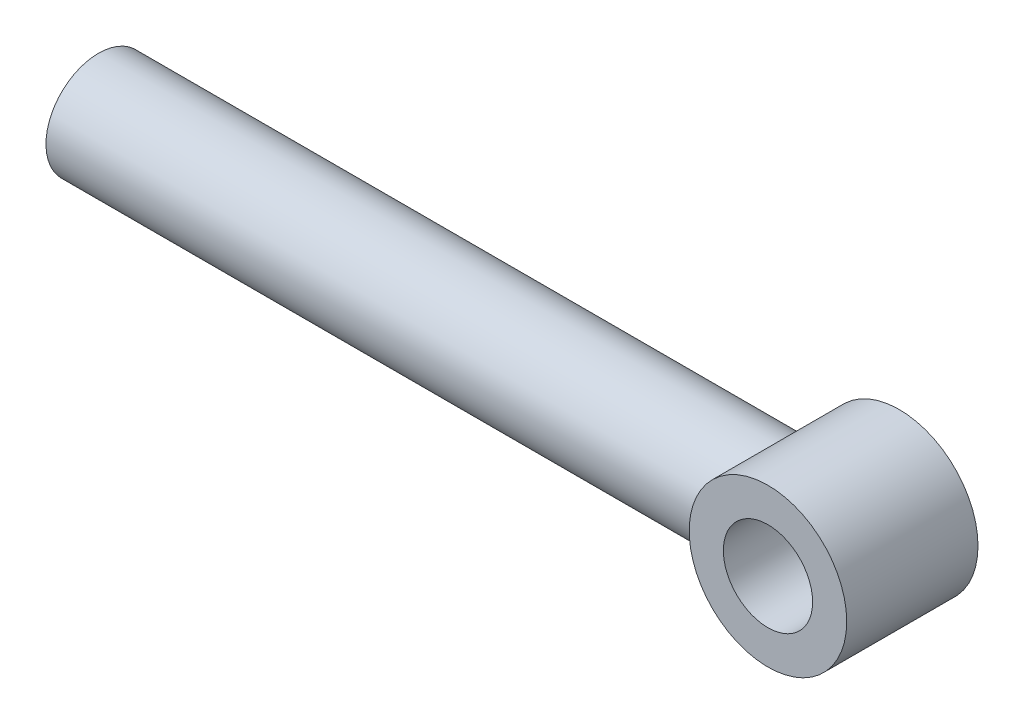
ISO-10303-21;
HEADER;
FILE_DESCRIPTION(('STEP AP214'),'2;1');
FILE_NAME('part.step','',(''),(''),'','','');
FILE_SCHEMA(('AUTOMOTIVE_DESIGN { 1 0 10303 214 1 1 1 1 }'));
ENDSEC;
DATA;
#1=APPLICATION_CONTEXT('core data for automotive mechanical design processes');
#2=APPLICATION_PROTOCOL_DEFINITION('international standard','automotive_design',2000,#1);
#3=PRODUCT_CONTEXT('',#1,'mechanical');
#4=PRODUCT('Part','Part','',(#3));
#5=PRODUCT_RELATED_PRODUCT_CATEGORY('part','',(#4));
#6=PRODUCT_DEFINITION_FORMATION('','',#4);
#7=PRODUCT_DEFINITION_CONTEXT('part definition',#1,'design');
#8=PRODUCT_DEFINITION('design','',#6,#7);
#9=PRODUCT_DEFINITION_SHAPE('','',#8);
#10=(LENGTH_UNIT() NAMED_UNIT(*) SI_UNIT(.MILLI.,.METRE.));
#11=(NAMED_UNIT(*) PLANE_ANGLE_UNIT() SI_UNIT($,.RADIAN.));
#12=(NAMED_UNIT(*) SI_UNIT($,.STERADIAN.) SOLID_ANGLE_UNIT());
#13=UNCERTAINTY_MEASURE_WITH_UNIT(LENGTH_MEASURE(1.E-05),#10,'distance_accuracy_value','');
#14=(GEOMETRIC_REPRESENTATION_CONTEXT(3) GLOBAL_UNCERTAINTY_ASSIGNED_CONTEXT((#13)) GLOBAL_UNIT_ASSIGNED_CONTEXT((#10,
#11,#12)) REPRESENTATION_CONTEXT('',''));
#15=CARTESIAN_POINT('',(0.,0.,0.));
#16=DIRECTION('',(0.,0.,1.));
#17=DIRECTION('',(1.,0.,0.));
#18=AXIS2_PLACEMENT_3D('',#15,#16,#17);
#19=CARTESIAN_POINT('',(0.,0.,62.5));
#20=DIRECTION('',(0.,0.,-1.));
#21=DIRECTION('',(-1.,0.,0.));
#22=AXIS2_PLACEMENT_3D('',#19,#20,#21);
#23=CYLINDRICAL_SURFACE('',#22,75.);
#24=CARTESIAN_POINT('',(0.,0.,-62.5));
#25=DIRECTION('',(0.,0.,1.));
#26=DIRECTION('',(1.,0.,0.));
#27=AXIS2_PLACEMENT_3D('',#24,#25,#26);
#28=CIRCLE('',#27,75.);
#29=CARTESIAN_POINT('',(75.,0.,-62.5));
#30=VERTEX_POINT('',#29);
#31=EDGE_CURVE('E47',#30,#30,#28,.T.);
#32=ORIENTED_EDGE('',*,*,#31,.T.);
#33=EDGE_LOOP('',(#32));
#34=FACE_BOUND('',#33,.T.);
#35=CARTESIAN_POINT('',(0.,0.,62.5));
#36=DIRECTION('',(0.,0.,1.));
#37=DIRECTION('',(1.,0.,0.));
#38=AXIS2_PLACEMENT_3D('',#35,#36,#37);
#39=CIRCLE('',#38,75.);
#40=CARTESIAN_POINT('',(75.,0.,62.5));
#41=VERTEX_POINT('',#40);
#42=EDGE_CURVE('E43',#41,#41,#39,.T.);
#43=ORIENTED_EDGE('',*,*,#42,.F.);
#44=EDGE_LOOP('',(#43));
#45=FACE_BOUND('',#44,.T.);
#46=CARTESIAN_POINT('',(-75.,0.,50.));
#47=CARTESIAN_POINT('',(-74.9999993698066,1.25607912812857,49.9999992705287));
#48=CARTESIAN_POINT('',(-74.9683781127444,2.51216621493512,49.9526046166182));
#49=CARTESIAN_POINT('',(-74.8426887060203,5.01407179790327,49.7637718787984));
#50=CARTESIAN_POINT('',(-74.7486202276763,6.25989023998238,49.6223332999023));
#51=CARTESIAN_POINT('',(-74.5003130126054,8.73197178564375,49.2475006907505));
#52=CARTESIAN_POINT('',(-74.3460508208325,9.95822707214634,49.0140708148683));
#53=CARTESIAN_POINT('',(-73.9810246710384,12.3818417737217,48.4585988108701));
#54=CARTESIAN_POINT('',(-73.7702600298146,13.5792008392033,48.1365556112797));
#55=CARTESIAN_POINT('',(-73.2981128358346,15.9317078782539,47.409801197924));
#56=CARTESIAN_POINT('',(-73.0369769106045,17.0870301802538,47.0054922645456));
#57=CARTESIAN_POINT('',(-72.4689183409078,19.3551767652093,46.1178965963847));
#58=CARTESIAN_POINT('',(-72.1619959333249,20.4680012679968,45.6346102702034));
#59=CARTESIAN_POINT('',(-71.5083591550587,22.6461387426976,44.5938272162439));
#60=CARTESIAN_POINT('',(-71.1616447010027,23.7114516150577,44.0363303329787));
#61=CARTESIAN_POINT('',(-70.4347519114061,25.790674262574,42.851755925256));
#62=CARTESIAN_POINT('',(-70.0545719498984,26.8045815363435,42.2246750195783));
#63=CARTESIAN_POINT('',(-69.2338946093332,28.861666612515,40.849261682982));
#64=CARTESIAN_POINT('',(-68.7910162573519,29.9000336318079,40.0951562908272));
#65=CARTESIAN_POINT('',(-67.8821640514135,31.9096887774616,38.5150098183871));
#66=CARTESIAN_POINT('',(-67.4161891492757,32.8809738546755,37.6889654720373));
#67=CARTESIAN_POINT('',(-66.4693490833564,34.7552786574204,35.9679238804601));
#68=CARTESIAN_POINT('',(-65.9884648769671,35.6582055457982,35.0728360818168));
#69=CARTESIAN_POINT('',(-65.0216326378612,37.3921493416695,33.2180538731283));
#70=CARTESIAN_POINT('',(-64.5356843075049,38.2231619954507,32.2583556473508));
#71=CARTESIAN_POINT('',(-63.4920916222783,39.9363542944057,30.1205689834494));
#72=CARTESIAN_POINT('',(-62.9352413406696,40.8058966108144,28.9319232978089));
#73=CARTESIAN_POINT('',(-61.8442348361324,42.4412194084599,26.4749144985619));
#74=CARTESIAN_POINT('',(-61.3100837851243,43.2069763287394,25.2065333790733));
#75=CARTESIAN_POINT('',(-60.2836354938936,44.6279110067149,22.595480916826));
#76=CARTESIAN_POINT('',(-59.7912819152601,45.2832388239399,21.2529137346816));
#77=CARTESIAN_POINT('',(-58.8680528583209,46.4771135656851,18.4967747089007));
#78=CARTESIAN_POINT('',(-58.4371478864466,47.0157165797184,17.0832373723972));
#79=CARTESIAN_POINT('',(-57.7708886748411,47.8300721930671,14.6101230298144));
#80=CARTESIAN_POINT('',(-57.5149970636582,48.1368155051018,13.5662004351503));
#81=CARTESIAN_POINT('',(-57.0529757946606,48.6835315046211,11.4502022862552));
#82=CARTESIAN_POINT('',(-56.8468380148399,48.9235150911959,10.3781313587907));
#83=CARTESIAN_POINT('',(-56.4917106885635,49.3331558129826,8.21290481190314));
#84=CARTESIAN_POINT('',(-56.3426367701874,49.5029168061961,7.119782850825));
#85=CARTESIAN_POINT('',(-56.1069379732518,49.7699049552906,4.91794365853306));
#86=CARTESIAN_POINT('',(-56.0203134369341,49.8671317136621,3.80922634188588));
#87=CARTESIAN_POINT('',(-55.9128944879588,49.9875475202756,1.57993457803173));
#88=CARTESIAN_POINT('',(-55.8923741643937,50.0104283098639,0.459330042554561));
#89=CARTESIAN_POINT('',(-55.9188255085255,49.9808494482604,-1.780076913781));
#90=CARTESIAN_POINT('',(-55.9657974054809,49.9283895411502,-2.89887932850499));
#91=CARTESIAN_POINT('',(-56.1252713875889,49.7490517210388,-5.12656174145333));
#92=CARTESIAN_POINT('',(-56.2378221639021,49.6221185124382,-6.23543374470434));
#93=CARTESIAN_POINT('',(-56.523896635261,49.2960030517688,-8.43444104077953));
#94=CARTESIAN_POINT('',(-56.6974214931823,49.096819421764,-9.52457597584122));
#95=CARTESIAN_POINT('',(-57.0900007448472,48.6396771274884,-11.6315017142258));
#96=CARTESIAN_POINT('',(-57.3066828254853,48.3847316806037,-12.649396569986));
#97=CARTESIAN_POINT('',(-57.7832883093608,47.8145330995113,-14.6581382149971));
#98=CARTESIAN_POINT('',(-58.0432284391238,47.4992566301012,-15.6489743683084));
#99=CARTESIAN_POINT('',(-58.5993950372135,46.8113917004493,-17.6001100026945));
#100=CARTESIAN_POINT('',(-58.8956252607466,46.4387973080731,-18.5604063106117));
#101=CARTESIAN_POINT('',(-59.5174078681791,45.6391782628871,-20.4478801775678));
#102=CARTESIAN_POINT('',(-59.8429537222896,45.2121657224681,-21.3750650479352));
#103=CARTESIAN_POINT('',(-60.5855151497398,44.2137646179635,-23.3803350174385));
#104=CARTESIAN_POINT('',(-61.0076592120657,43.6306819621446,-24.4507093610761));
#105=CARTESIAN_POINT('',(-61.8743922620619,42.3925789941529,-26.5394717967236));
#106=CARTESIAN_POINT('',(-62.3189833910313,41.7375518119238,-27.5578549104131));
#107=CARTESIAN_POINT('',(-63.2213580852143,40.3576530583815,-29.5418590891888));
#108=CARTESIAN_POINT('',(-63.6791556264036,39.6327054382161,-30.5074208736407));
#109=CARTESIAN_POINT('',(-64.5984937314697,38.1158937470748,-32.382604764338));
#110=CARTESIAN_POINT('',(-65.0600345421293,37.3240252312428,-33.2922231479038));
#111=CARTESIAN_POINT('',(-66.0776235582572,35.4973720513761,-35.2432553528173));
#112=CARTESIAN_POINT('',(-66.6325757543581,34.4470402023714,-36.2707577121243));
#113=CARTESIAN_POINT('',(-67.7214915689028,32.2536688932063,-38.2343790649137));
#114=CARTESIAN_POINT('',(-68.255451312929,31.1106124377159,-39.1704812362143));
#115=CARTESIAN_POINT('',(-69.2883502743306,28.7367153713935,-40.9437956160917));
#116=CARTESIAN_POINT('',(-69.7873150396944,27.5059401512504,-41.7810802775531));
#117=CARTESIAN_POINT('',(-70.7374190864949,24.9611838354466,-43.3494130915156));
#118=CARTESIAN_POINT('',(-71.1885715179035,23.6472257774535,-44.0804904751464));
#119=CARTESIAN_POINT('',(-71.9479110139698,21.2083653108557,-45.2954763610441));
#120=CARTESIAN_POINT('',(-72.2667869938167,20.0968929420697,-45.7997439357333));
#121=CARTESIAN_POINT('',(-72.85929326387,17.8296258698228,-46.7290579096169));
#122=CARTESIAN_POINT('',(-73.1329288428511,16.6738363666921,-47.1541135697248));
#123=CARTESIAN_POINT('',(-73.629069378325,14.3248068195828,-47.9199844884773));
#124=CARTESIAN_POINT('',(-73.8516086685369,13.1315925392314,-48.2608563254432));
#125=CARTESIAN_POINT('',(-74.2408263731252,10.7143858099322,-48.8543809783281));
#126=CARTESIAN_POINT('',(-74.4075039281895,9.49039288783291,-49.1070324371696));
#127=CARTESIAN_POINT('',(-74.6816447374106,7.0149328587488,-49.5214332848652));
#128=CARTESIAN_POINT('',(-74.7888458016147,5.76336899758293,-49.6827802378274));
#129=CARTESIAN_POINT('',(-74.9402390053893,3.24779978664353,-49.9103863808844));
#130=CARTESIAN_POINT('',(-74.9844310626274,1.98379442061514,-49.9766454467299));
#131=CARTESIAN_POINT('',(-75.0086794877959,-0.546161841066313,-50.0130200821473));
#132=CARTESIAN_POINT('',(-74.9887384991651,-1.81211265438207,-49.9831396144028));
#133=CARTESIAN_POINT('',(-74.8852333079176,-4.33545391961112,-49.8277186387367));
#134=CARTESIAN_POINT('',(-74.8016718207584,-5.59284473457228,-49.7021822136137));
#135=CARTESIAN_POINT('',(-74.5811036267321,-8.00105441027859,-49.3695781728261));
#136=CARTESIAN_POINT('',(-74.4482725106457,-9.1531452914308,-49.1688708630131));
#137=CARTESIAN_POINT('',(-74.1322766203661,-11.4337539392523,-48.6890852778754));
#138=CARTESIAN_POINT('',(-73.949114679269,-12.5622730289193,-48.4100114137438));
#139=CARTESIAN_POINT('',(-73.5361116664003,-14.7892901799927,-47.7767443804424));
#140=CARTESIAN_POINT('',(-73.3062675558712,-15.8877862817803,-47.422546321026));
#141=CARTESIAN_POINT('',(-72.8042512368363,-18.0491596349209,-46.6427698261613));
#142=CARTESIAN_POINT('',(-72.5320767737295,-19.1120349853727,-46.217187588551));
#143=CARTESIAN_POINT('',(-71.9326221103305,-21.2606669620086,-45.2707880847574));
#144=CARTESIAN_POINT('',(-71.6030042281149,-22.3439174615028,-44.7457668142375));
#145=CARTESIAN_POINT('',(-70.9077575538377,-24.4608128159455,-43.6245744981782));
#146=CARTESIAN_POINT('',(-70.5421276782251,-25.4944561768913,-43.0284013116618));
#147=CARTESIAN_POINT('',(-69.7810939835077,-27.5092556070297,-41.7690428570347));
#148=CARTESIAN_POINT('',(-69.3856760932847,-28.4903864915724,-41.10582586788));
#149=CARTESIAN_POINT('',(-68.5718169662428,-30.3970494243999,-39.7166332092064));
#150=CARTESIAN_POINT('',(-68.1533744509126,-31.3225783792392,-38.9906540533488));
#151=CARTESIAN_POINT('',(-67.2327199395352,-33.2578367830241,-37.3598822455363));
#152=CARTESIAN_POINT('',(-66.7277262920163,-34.2577309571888,-36.4449686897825));
#153=CARTESIAN_POINT('',(-65.7067457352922,-36.1774209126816,-34.5401662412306));
#154=CARTESIAN_POINT('',(-65.1907573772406,-37.0972060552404,-33.5502674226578));
#155=CARTESIAN_POINT('',(-64.1589349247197,-38.8544700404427,-31.4985058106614));
#156=CARTESIAN_POINT('',(-63.6431011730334,-39.6918925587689,-30.4365945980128));
#157=CARTESIAN_POINT('',(-62.6243153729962,-41.2805689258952,-28.2444115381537));
#158=CARTESIAN_POINT('',(-62.121362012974,-42.0318315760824,-27.1141466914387));
#159=CARTESIAN_POINT('',(-61.1832557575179,-43.3846567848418,-24.8862068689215));
#160=CARTESIAN_POINT('',(-60.745965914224,-43.993506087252,-23.7938574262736));
#161=CARTESIAN_POINT('',(-59.9048518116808,-45.1321365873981,-21.5561130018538));
#162=CARTESIAN_POINT('',(-59.5010280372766,-45.6619166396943,-20.4107172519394));
#163=CARTESIAN_POINT('',(-58.7397976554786,-46.6370927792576,-18.0716535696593));
#164=CARTESIAN_POINT('',(-58.3823233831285,-47.0826123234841,-16.8780594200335));
#165=CARTESIAN_POINT('',(-57.7261478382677,-47.8848711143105,-14.4456870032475));
#166=CARTESIAN_POINT('',(-57.4274330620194,-48.2416307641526,-13.2069191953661));
#167=CARTESIAN_POINT('',(-56.9488612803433,-48.8051035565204,-10.9174566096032));
#168=CARTESIAN_POINT('',(-56.7572902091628,-49.0272622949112,-9.87300003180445));
#169=CARTESIAN_POINT('',(-56.4286284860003,-49.4051907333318,-7.76367173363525));
#170=CARTESIAN_POINT('',(-56.2915312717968,-49.5609684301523,-6.698802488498));
#171=CARTESIAN_POINT('',(-56.0769505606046,-49.8036343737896,-4.55622797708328));
#172=CARTESIAN_POINT('',(-55.9994121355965,-49.8905860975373,-3.47853547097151));
#173=CARTESIAN_POINT('',(-55.9067879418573,-49.9943596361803,-1.31704747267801));
#174=CARTESIAN_POINT('',(-55.8917030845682,-50.0111804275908,-0.233251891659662));
#175=CARTESIAN_POINT('',(-55.9246124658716,-49.9743764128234,1.93278821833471));
#176=CARTESIAN_POINT('',(-55.9726427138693,-49.9207113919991,3.01503150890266));
#177=CARTESIAN_POINT('',(-56.1299110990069,-49.743813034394,5.16925653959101));
#178=CARTESIAN_POINT('',(-56.2391487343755,-49.6205802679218,6.2412383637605));
#179=CARTESIAN_POINT('',(-56.5148212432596,-49.3063738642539,8.36895492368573));
#180=CARTESIAN_POINT('',(-56.6813211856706,-49.1153231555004,9.42466974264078));
#181=CARTESIAN_POINT('',(-57.0656505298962,-48.668246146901,11.5127029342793));
#182=CARTESIAN_POINT('',(-57.2834865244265,-48.4122115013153,12.5450182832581));
#183=CARTESIAN_POINT('',(-57.8277047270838,-47.7617121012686,14.8530792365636));
#184=CARTESIAN_POINT('',(-58.1675437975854,-47.3485400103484,16.1204019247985));
#185=CARTESIAN_POINT('',(-58.9040695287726,-46.4290551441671,18.6036912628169));
#186=CARTESIAN_POINT('',(-59.3007718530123,-45.9227166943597,19.8196436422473));
#187=CARTESIAN_POINT('',(-60.1371237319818,-44.821920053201,22.1971494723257));
#188=CARTESIAN_POINT('',(-60.5768190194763,-44.2273676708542,23.3586430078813));
#189=CARTESIAN_POINT('',(-61.485450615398,-42.9552127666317,25.6229623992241));
#190=CARTESIAN_POINT('',(-61.9543853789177,-42.2776146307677,26.7257913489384));
#191=CARTESIAN_POINT('',(-62.9180640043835,-40.8299760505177,28.8901139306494));
#192=CARTESIAN_POINT('',(-63.4131219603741,-40.0584799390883,29.9504927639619));
#193=CARTESIAN_POINT('',(-64.4093060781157,-38.4362771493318,32.0057265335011));
#194=CARTESIAN_POINT('',(-64.9104322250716,-37.5855706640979,33.0005816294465));
#195=CARTESIAN_POINT('',(-65.9081269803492,-35.8072393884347,34.9221349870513));
#196=CARTESIAN_POINT('',(-66.404694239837,-34.8795925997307,35.848813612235));
#197=CARTESIAN_POINT('',(-67.3829668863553,-32.9500596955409,37.6300151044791));
#198=CARTESIAN_POINT('',(-67.8646710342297,-31.9481674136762,38.4845319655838));
#199=CARTESIAN_POINT('',(-68.8711034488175,-29.7231744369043,40.2344703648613));
#200=CARTESIAN_POINT('',(-69.3920555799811,-28.4889830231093,41.1180993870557));
#201=CARTESIAN_POINT('',(-70.1386126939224,-26.571536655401,42.3619471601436));
#202=CARTESIAN_POINT('',(-70.3817088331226,-25.9211928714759,42.7630525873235));
#203=CARTESIAN_POINT('',(-70.8545815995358,-24.5992016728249,43.5369458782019));
#204=CARTESIAN_POINT('',(-71.0843600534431,-23.9275571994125,43.9097376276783));
#205=CARTESIAN_POINT('',(-71.5286753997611,-22.564615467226,44.6254411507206));
#206=CARTESIAN_POINT('',(-71.7432283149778,-21.8733399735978,44.9683844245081));
#207=CARTESIAN_POINT('',(-72.1557008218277,-20.4716502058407,45.6235677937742));
#208=CARTESIAN_POINT('',(-72.3536227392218,-19.7612386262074,45.9358121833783));
#209=CARTESIAN_POINT('',(-72.7312468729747,-18.3226242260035,46.5283397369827));
#210=CARTESIAN_POINT('',(-72.9109529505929,-17.5944252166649,46.8086296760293));
#211=CARTESIAN_POINT('',(-73.2506766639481,-16.1217137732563,47.3360566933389));
#212=CARTESIAN_POINT('',(-73.4106957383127,-15.3772025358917,47.5831961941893));
#213=CARTESIAN_POINT('',(-73.7927029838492,-13.4557598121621,48.1709174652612));
#214=CARTESIAN_POINT('',(-73.9997650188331,-12.2682623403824,48.4871890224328));
#215=CARTESIAN_POINT('',(-74.3582490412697,-9.86541480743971,49.0325542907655));
#216=CARTESIAN_POINT('',(-74.5096800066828,-8.65006927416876,49.2616620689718));
#217=CARTESIAN_POINT('',(-74.7533681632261,-6.20060249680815,49.6294778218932));
#218=CARTESIAN_POINT('',(-74.8456618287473,-4.96649330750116,49.7682415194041));
#219=CARTESIAN_POINT('',(-74.9689792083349,-2.4882589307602,49.9535047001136));
#220=CARTESIAN_POINT('',(-75.0000006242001,-1.24413336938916,50.0000007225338));
#221=CARTESIAN_POINT('',(-75.,0.,50.));
#222=B_SPLINE_CURVE_WITH_KNOTS('',3,(#46,#47,#48,#49,#50,#51,#52,#53,#54,#55,#56,#57,#58,#59,
#60,#61,#62,#63,#64,#65,#66,#67,#68,#69,#70,#71,#72,#73,#74,#75,#76,#77,#78,#79,#80,#81,#82,#83,
#84,#85,#86,#87,#88,#89,#90,#91,#92,#93,#94,#95,#96,#97,#98,#99,#100,#101,#102,#103,#104,#105,
#106,#107,#108,#109,#110,#111,#112,#113,#114,#115,#116,#117,#118,#119,#120,#121,#122,#123,#124,
#125,#126,#127,#128,#129,#130,#131,#132,#133,#134,#135,#136,#137,#138,#139,#140,#141,#142,#143,
#144,#145,#146,#147,#148,#149,#150,#151,#152,#153,#154,#155,#156,#157,#158,#159,#160,#161,#162,
#163,#164,#165,#166,#167,#168,#169,#170,#171,#172,#173,#174,#175,#176,#177,#178,#179,#180,#181,
#182,#183,#184,#185,#186,#187,#188,#189,#190,#191,#192,#193,#194,#195,#196,#197,#198,#199,#200,
#201,#202,#203,#204,#205,#206,#207,#208,#209,#210,#211,#212,#213,#214,#215,#216,#217,#218,#219,
#220,#221),.UNSPECIFIED.,.T.,.F.,(4,2,2,2,2,2,2,2,2,2,2,2,2,2,2,2,2,2,2,2,2,2,2,2,2,2,2,2,2,2,2,
2,2,2,2,2,2,2,2,2,2,2,2,2,2,2,2,2,2,2,2,2,2,2,2,2,2,2,2,2,2,2,2,2,2,2,2,2,2,2,2,2,2,2,2,2,2,2,2,
2,2,2,2,2,2,2,2,4),(0.,3.76697150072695,7.53396282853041,11.3024234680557,15.0709296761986,
18.8214325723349,22.5719160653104,26.3224074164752,30.0730810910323,34.141861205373,
38.210826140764,42.2852215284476,46.3598577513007,51.0778298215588,55.7968711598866,
60.5094472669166,65.219753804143,68.56991274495,71.9195244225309,75.2641642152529,
78.6088223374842,81.9673307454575,85.3258505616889,88.6868672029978,92.0479479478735,
95.2593158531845,98.4719283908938,101.684873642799,104.897105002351,108.763339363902,
112.62994323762,116.500801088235,120.371916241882,125.078303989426,129.785556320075,
134.489335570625,139.191817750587,142.972498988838,146.752737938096,150.530429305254,
154.308178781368,158.102451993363,161.896730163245,165.6908519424,169.484811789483,
173.011740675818,176.538471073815,180.06543111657,183.592579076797,187.333121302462,
191.073776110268,194.816209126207,198.5588501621,202.893439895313,207.228604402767,
211.566713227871,215.904378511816,219.875264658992,223.846208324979,227.811287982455,
231.775455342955,235.026760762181,238.277674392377,241.525586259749,244.773545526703,
248.023358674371,251.273145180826,254.526636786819,257.780546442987,261.90140788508,
266.023406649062,270.149838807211,274.276053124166,278.47722241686,282.678381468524,
286.880745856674,291.083459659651,295.890616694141,298.295380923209,300.699814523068,
303.101679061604,305.503207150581,307.904225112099,310.305067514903,314.038981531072,
317.772292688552,321.503299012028,325.23444527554),.UNSPECIFIED.);
#223=CARTESIAN_POINT('',(-75.,0.,50.));
#224=VERTEX_POINT('',#223);
#225=EDGE_CURVE('E10',#224,#224,#222,.T.);
#226=ORIENTED_EDGE('',*,*,#225,.F.);
#227=EDGE_LOOP('',(#226));
#228=FACE_BOUND('',#227,.T.);
#229=ADVANCED_FACE('F32',(#34,#45,#228),#23,.T.);
#230=CARTESIAN_POINT('',(0.,0.,62.5));
#231=DIRECTION('',(0.,0.,1.));
#232=DIRECTION('',(1.,0.,0.));
#233=AXIS2_PLACEMENT_3D('',#230,#231,#232);
#234=PLANE('',#233);
#235=CARTESIAN_POINT('',(0.,0.,62.5));
#236=DIRECTION('',(0.,0.,1.));
#237=DIRECTION('',(1.,0.,0.));
#238=AXIS2_PLACEMENT_3D('',#235,#236,#237);
#239=CIRCLE('',#238,42.5);
#240=CARTESIAN_POINT('',(42.5,0.,62.5));
#241=VERTEX_POINT('',#240);
#242=EDGE_CURVE('E59',#241,#241,#239,.T.);
#243=ORIENTED_EDGE('',*,*,#242,.F.);
#244=EDGE_LOOP('',(#243));
#245=FACE_BOUND('',#244,.T.);
#246=ORIENTED_EDGE('',*,*,#42,.T.);
#247=EDGE_LOOP('',(#246));
#248=FACE_BOUND('',#247,.T.);
#249=ADVANCED_FACE('F65',(#245,#248),#234,.T.);
#250=CARTESIAN_POINT('',(0.,0.,-62.5));
#251=DIRECTION('',(0.,0.,1.));
#252=DIRECTION('',(1.,0.,0.));
#253=AXIS2_PLACEMENT_3D('',#250,#251,#252);
#254=PLANE('',#253);
#255=CARTESIAN_POINT('',(0.,0.,-62.5));
#256=DIRECTION('',(0.,0.,1.));
#257=DIRECTION('',(1.,0.,0.));
#258=AXIS2_PLACEMENT_3D('',#255,#256,#257);
#259=CIRCLE('',#258,42.5);
#260=CARTESIAN_POINT('',(42.5,0.,-62.5));
#261=VERTEX_POINT('',#260);
#262=EDGE_CURVE('E56',#261,#261,#259,.T.);
#263=ORIENTED_EDGE('',*,*,#262,.T.);
#264=EDGE_LOOP('',(#263));
#265=FACE_BOUND('',#264,.T.);
#266=ORIENTED_EDGE('',*,*,#31,.F.);
#267=EDGE_LOOP('',(#266));
#268=FACE_BOUND('',#267,.T.);
#269=ADVANCED_FACE('F67',(#265,#268),#254,.F.);
#270=CARTESIAN_POINT('',(0.,0.,0.));
#271=DIRECTION('',(1.,0.,0.));
#272=DIRECTION('',(0.,1.,0.));
#273=AXIS2_PLACEMENT_3D('',#270,#271,#272);
#274=CYLINDRICAL_SURFACE('',#273,50.);
#275=CARTESIAN_POINT('',(-700.,0.,0.));
#276=DIRECTION('',(1.,0.,0.));
#277=DIRECTION('',(0.,1.,0.));
#278=AXIS2_PLACEMENT_3D('',#275,#276,#277);
#279=CIRCLE('',#278,50.);
#280=CARTESIAN_POINT('',(-700.,50.0000000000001,0.));
#281=VERTEX_POINT('',#280);
#282=EDGE_CURVE('E52',#281,#281,#279,.T.);
#283=ORIENTED_EDGE('',*,*,#282,.T.);
#284=EDGE_LOOP('',(#283));
#285=FACE_BOUND('',#284,.T.);
#286=ORIENTED_EDGE('',*,*,#225,.T.);
#287=EDGE_LOOP('',(#286));
#288=FACE_BOUND('',#287,.T.);
#289=ADVANCED_FACE('F73',(#285,#288),#274,.T.);
#290=CARTESIAN_POINT('',(-700.,50.0000000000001,0.));
#291=DIRECTION('',(-1.,0.,0.));
#292=DIRECTION('',(0.,-1.,0.));
#293=AXIS2_PLACEMENT_3D('',#290,#291,#292);
#294=PLANE('',#293);
#295=ORIENTED_EDGE('',*,*,#282,.F.);
#296=EDGE_LOOP('',(#295));
#297=FACE_BOUND('',#296,.T.);
#298=ADVANCED_FACE('F77',(#297),#294,.T.);
#299=CARTESIAN_POINT('',(0.,0.,-62.5));
#300=DIRECTION('',(0.,0.,1.));
#301=DIRECTION('',(1.,0.,0.));
#302=AXIS2_PLACEMENT_3D('',#299,#300,#301);
#303=CYLINDRICAL_SURFACE('',#302,42.5);
#304=ORIENTED_EDGE('',*,*,#262,.F.);
#305=EDGE_LOOP('',(#304));
#306=FACE_BOUND('',#305,.T.);
#307=ORIENTED_EDGE('',*,*,#242,.T.);
#308=EDGE_LOOP('',(#307));
#309=FACE_BOUND('',#308,.T.);
#310=ADVANCED_FACE('F63',(#306,#309),#303,.F.);
#311=CLOSED_SHELL('',(#229,#249,#269,#289,#298,#310));
#312=MANIFOLD_SOLID_BREP('B2',#311);
#313=ADVANCED_BREP_SHAPE_REPRESENTATION('',(#18,#312),#14);
#314=SHAPE_DEFINITION_REPRESENTATION(#9,#313);
ENDSEC;
END-ISO-10303-21;
